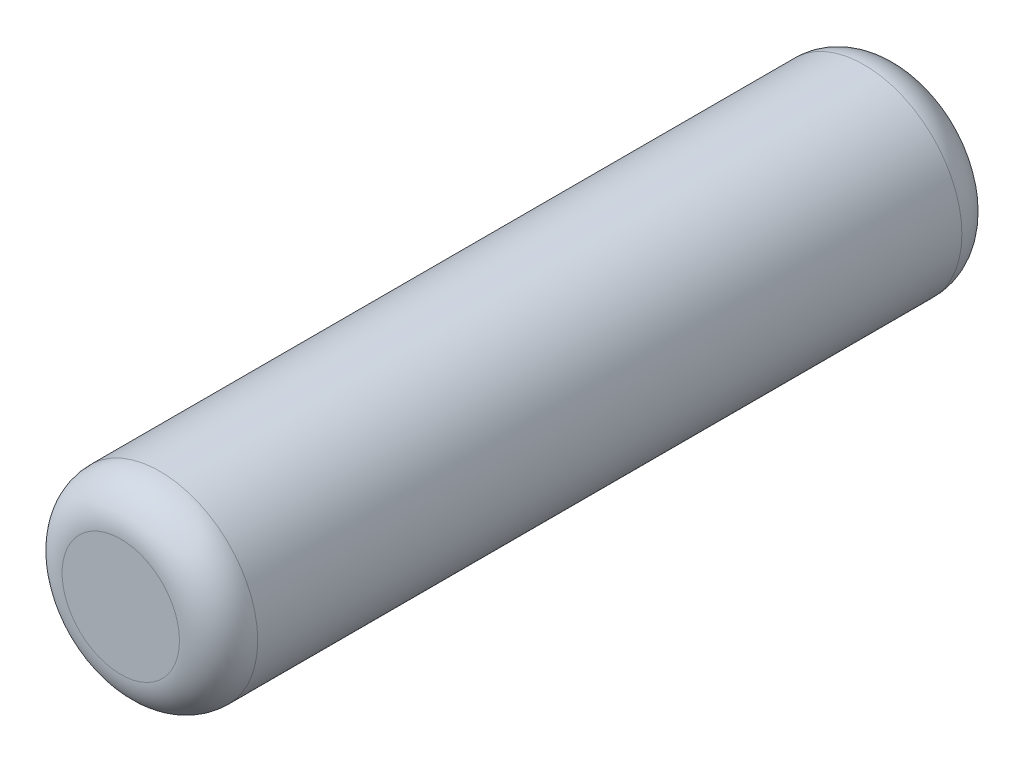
ISO-10303-21;
HEADER;
FILE_DESCRIPTION(('STEP AP214'),'2;1');
FILE_NAME('part.step','',(''),(''),'','','');
FILE_SCHEMA(('AUTOMOTIVE_DESIGN { 1 0 10303 214 1 1 1 1 }'));
ENDSEC;
DATA;
#1=APPLICATION_CONTEXT('core data for automotive mechanical design processes');
#2=APPLICATION_PROTOCOL_DEFINITION('international standard','automotive_design',2000,#1);
#3=PRODUCT_CONTEXT('',#1,'mechanical');
#4=PRODUCT('Part','Part','',(#3));
#5=PRODUCT_RELATED_PRODUCT_CATEGORY('part','',(#4));
#6=PRODUCT_DEFINITION_FORMATION('','',#4);
#7=PRODUCT_DEFINITION_CONTEXT('part definition',#1,'design');
#8=PRODUCT_DEFINITION('design','',#6,#7);
#9=PRODUCT_DEFINITION_SHAPE('','',#8);
#10=(LENGTH_UNIT() NAMED_UNIT(*) SI_UNIT(.MILLI.,.METRE.));
#11=(NAMED_UNIT(*) PLANE_ANGLE_UNIT() SI_UNIT($,.RADIAN.));
#12=(NAMED_UNIT(*) SI_UNIT($,.STERADIAN.) SOLID_ANGLE_UNIT());
#13=UNCERTAINTY_MEASURE_WITH_UNIT(LENGTH_MEASURE(1.E-05),#10,'distance_accuracy_value','');
#14=(GEOMETRIC_REPRESENTATION_CONTEXT(3) GLOBAL_UNCERTAINTY_ASSIGNED_CONTEXT((#13)) GLOBAL_UNIT_ASSIGNED_CONTEXT((#10,
#11,#12)) REPRESENTATION_CONTEXT('',''));
#15=CARTESIAN_POINT('',(0.,0.,0.));
#16=DIRECTION('',(0.,0.,1.));
#17=DIRECTION('',(1.,0.,0.));
#18=AXIS2_PLACEMENT_3D('',#15,#16,#17);
#19=CARTESIAN_POINT('',(0.,0.,20.));
#20=DIRECTION('',(0.,0.,-1.));
#21=DIRECTION('',(-1.,0.,0.));
#22=AXIS2_PLACEMENT_3D('',#19,#20,#21);
#23=CYLINDRICAL_SURFACE('',#22,2.5);
#24=CARTESIAN_POINT('',(0.,0.,1.));
#25=DIRECTION('',(0.,0.,1.));
#26=DIRECTION('',(1.,0.,0.));
#27=AXIS2_PLACEMENT_3D('',#24,#25,#26);
#28=CIRCLE('',#27,2.5);
#29=CARTESIAN_POINT('',(2.5,0.,1.));
#30=VERTEX_POINT('',#29);
#31=EDGE_CURVE('E43',#30,#30,#28,.T.);
#32=ORIENTED_EDGE('',*,*,#31,.T.);
#33=EDGE_LOOP('',(#32));
#34=FACE_BOUND('',#33,.T.);
#35=CARTESIAN_POINT('',(0.,0.,19.));
#36=DIRECTION('',(0.,0.,1.));
#37=DIRECTION('',(1.,0.,0.));
#38=AXIS2_PLACEMENT_3D('',#35,#36,#37);
#39=CIRCLE('',#38,2.5);
#40=CARTESIAN_POINT('',(2.5,0.,19.));
#41=VERTEX_POINT('',#40);
#42=EDGE_CURVE('E47',#41,#41,#39,.F.);
#43=ORIENTED_EDGE('',*,*,#42,.T.);
#44=EDGE_LOOP('',(#43));
#45=FACE_BOUND('',#44,.T.);
#46=ADVANCED_FACE('F32',(#34,#45),#23,.T.);
#47=CARTESIAN_POINT('',(0.,0.,20.));
#48=DIRECTION('',(0.,0.,1.));
#49=DIRECTION('',(1.,0.,0.));
#50=AXIS2_PLACEMENT_3D('',#47,#48,#49);
#51=PLANE('',#50);
#52=CARTESIAN_POINT('',(0.,0.,20.));
#53=DIRECTION('',(0.,0.,1.));
#54=DIRECTION('',(1.,0.,0.));
#55=AXIS2_PLACEMENT_3D('',#52,#53,#54);
#56=CIRCLE('',#55,1.5);
#57=CARTESIAN_POINT('',(1.5,0.,20.));
#58=VERTEX_POINT('',#57);
#59=EDGE_CURVE('E10',#58,#58,#56,.T.);
#60=ORIENTED_EDGE('',*,*,#59,.T.);
#61=EDGE_LOOP('',(#60));
#62=FACE_BOUND('',#61,.T.);
#63=ADVANCED_FACE('F63',(#62),#51,.T.);
#64=CARTESIAN_POINT('',(0.,0.,0.));
#65=DIRECTION('',(0.,0.,1.));
#66=DIRECTION('',(1.,0.,0.));
#67=AXIS2_PLACEMENT_3D('',#64,#65,#66);
#68=PLANE('',#67);
#69=CARTESIAN_POINT('',(0.,0.,0.));
#70=DIRECTION('',(0.,0.,1.));
#71=DIRECTION('',(1.,0.,0.));
#72=AXIS2_PLACEMENT_3D('',#69,#70,#71);
#73=CIRCLE('',#72,1.5);
#74=CARTESIAN_POINT('',(1.5,0.,0.));
#75=VERTEX_POINT('',#74);
#76=EDGE_CURVE('E39',#75,#75,#73,.F.);
#77=ORIENTED_EDGE('',*,*,#76,.T.);
#78=EDGE_LOOP('',(#77));
#79=FACE_BOUND('',#78,.T.);
#80=ADVANCED_FACE('F60',(#79),#68,.F.);
#81=CARTESIAN_POINT('',(0.,0.,1.));
#82=DIRECTION('',(0.,0.,1.));
#83=DIRECTION('',(1.,0.,0.));
#84=AXIS2_PLACEMENT_3D('',#81,#82,#83);
#85=TOROIDAL_SURFACE('',#84,1.5,1.);
#86=ORIENTED_EDGE('',*,*,#76,.F.);
#87=EDGE_LOOP('',(#86));
#88=FACE_BOUND('',#87,.T.);
#89=ORIENTED_EDGE('',*,*,#31,.F.);
#90=EDGE_LOOP('',(#89));
#91=FACE_BOUND('',#90,.T.);
#92=ADVANCED_FACE('F56',(#88,#91),#85,.T.);
#93=CARTESIAN_POINT('',(0.,0.,19.));
#94=DIRECTION('',(0.,0.,1.));
#95=DIRECTION('',(1.,0.,0.));
#96=AXIS2_PLACEMENT_3D('',#93,#94,#95);
#97=TOROIDAL_SURFACE('',#96,1.5,1.);
#98=ORIENTED_EDGE('',*,*,#42,.F.);
#99=EDGE_LOOP('',(#98));
#100=FACE_BOUND('',#99,.T.);
#101=ORIENTED_EDGE('',*,*,#59,.F.);
#102=EDGE_LOOP('',(#101));
#103=FACE_BOUND('',#102,.T.);
#104=ADVANCED_FACE('F34',(#100,#103),#97,.T.);
#105=CLOSED_SHELL('',(#46,#63,#80,#92,#104));
#106=MANIFOLD_SOLID_BREP('B2',#105);
#107=ADVANCED_BREP_SHAPE_REPRESENTATION('',(#18,#106),#14);
#108=SHAPE_DEFINITION_REPRESENTATION(#9,#107);
ENDSEC;
END-ISO-10303-21;
